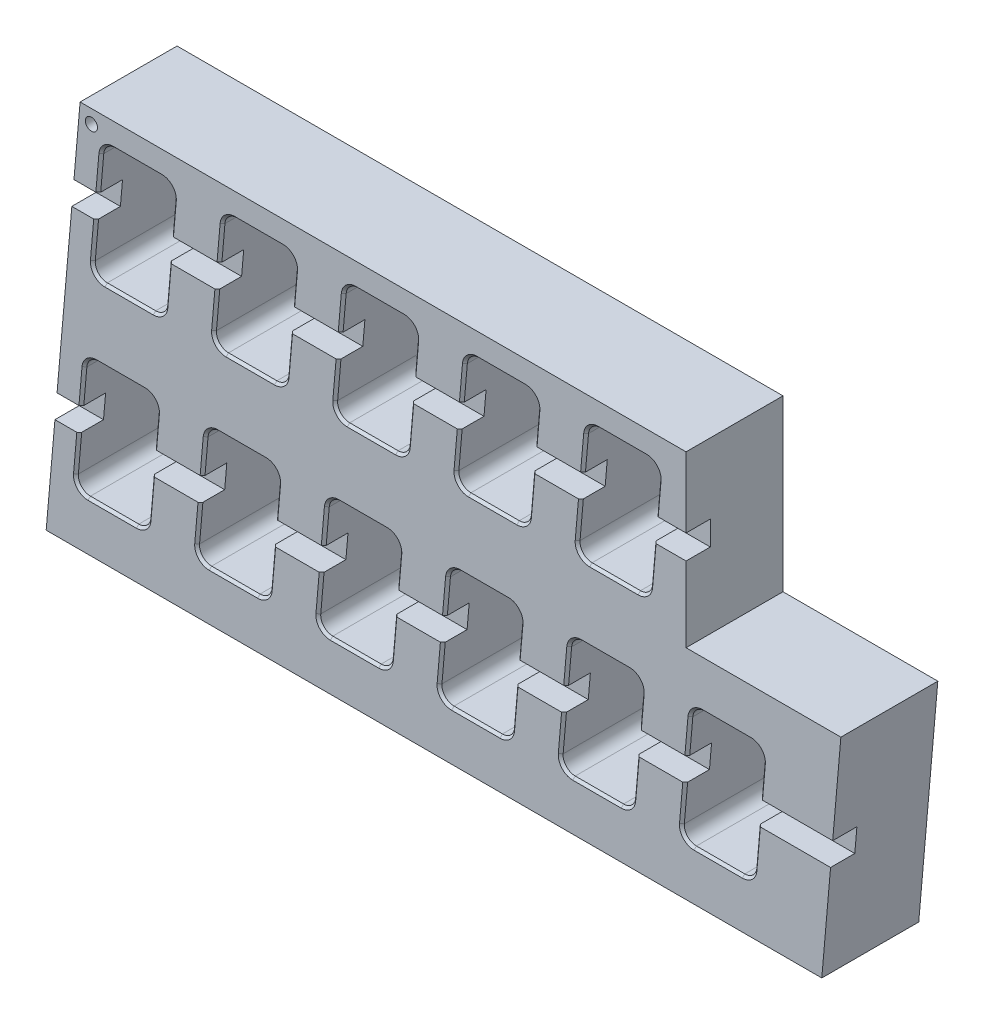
from build123d import *

# Parameters (mm, degrees)
EXTRUDE1_DEPTH             = 20
CUT_EXTRUDE1_DEPTH         = 20
CHAMFER1_SIZE              = 0.5
LPATTERN2_COUNT            = 6
LPATTERN2_PITCH            = 25
LPATTERN2_COUNT_DIR2       = 2
LPATTERN2_PITCH_DIR2       = 40
CHAMFER1_OF_LPATTERN2_SIZE = 0.5
CUT_EXTRUDE2_DEPTH         = 5
SKETCH6_R                  = 1.25
CUT_EXTRUDE5_DEPTH         = 10
SKETCH7_W                  = 40.988168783
SKETCH7_H                  = 43.465740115
CUT_EXTRUDE6_DEPTH         = 187.249019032


with BuildPart() as part:
    # Sketch1 → Extrude1 (new body)
    with BuildSketch(Plane.XY):
        Polygon((0, 0), (160, 0), (166.999093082, 80), (6.999093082, 80), align=None)
    extrude(amount=EXTRUDE1_DEPTH)

    # Sketch2 → Cut-Extrude1 (cut)
    with BuildSketch(Plane.XY.offset(20)):
        with BuildLine():
            Line((11.381090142, 72.717889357), (9.631316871, 52.717889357))
            ThreePointArc((9.631316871, 52.717889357), (10.278610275, 50.811024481), (12.121803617, 50))
            Line((12.121803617, 50), (22.102704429, 50))
            ThreePointArc((22.102704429, 50), (23.791679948, 50.656806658), (24.593191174, 52.282110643))
            Line((24.593191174, 52.282110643), (26.342964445, 72.282110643))
            ThreePointArc((26.342964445, 72.282110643), (25.695671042, 74.188975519), (23.852477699, 75))
            Line((23.852477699, 75), (13.871576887, 75))
            ThreePointArc((13.871576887, 75), (12.182601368, 74.343193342), (11.381090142, 72.717889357))
        make_face()
    cut_extrude1 = extrude(amount=-CUT_EXTRUDE1_DEPTH, mode=Mode.SUBTRACT)

    # Chamfer1
    chamfer1_edges = [part.edges().sort_by_distance(p)[0] for p in [
        (12.182601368, 74.343193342, 20),
        (10.506203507, 62.717889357, 20),
        (10.278610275, 50.811024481, 20),
        (17.112254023, 50, 20),
        (23.791679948, 50.656806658, 20),
        (25.468077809, 62.282110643, 20),
        (25.695671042, 74.188975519, 20),
        (18.862027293, 75, 20),
    ]]
    chamfer(chamfer1_edges, length=CHAMFER1_SIZE)

    # LPattern2: Cut-Extrude1 6 × 2
    with Locations(*[Vector(1, 0, 0) * (i * LPATTERN2_PITCH) + Vector(-0.08715574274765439, -0.9961946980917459, 0) * (j * LPATTERN2_PITCH_DIR2) for i in range(LPATTERN2_COUNT) for j in range(LPATTERN2_COUNT_DIR2) if (i, j) != (0, 0)]):
        add(cut_extrude1, mode=Mode.SUBTRACT)

    # Chamfer1 of LPattern2
    chamfer1_of_lpattern2_edges = [part.edges().sort_by_distance(p)[0] for p in [
        (8.696371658, 34.495405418, 20),
        (7.019973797, 22.870101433, 20),
        (6.792380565, 10.963236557, 20),
        (13.626024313, 10.152212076, 20),
        (20.305450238, 10.809018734, 20),
        (21.9818481, 22.434322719, 20),
        (22.209441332, 34.341187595, 20),
        (15.375797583, 35.152212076, 20),
        (37.182601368, 74.343193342, 20),
        (35.506203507, 62.717889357, 20),
        (35.278610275, 50.811024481, 20),
        (42.112254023, 50, 20),
        (48.791679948, 50.656806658, 20),
        (50.468077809, 62.282110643, 20),
        (50.695671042, 74.188975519, 20),
        (43.862027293, 75, 20),
        (33.696371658, 34.495405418, 20),
        (32.019973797, 22.870101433, 20),
        (31.792380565, 10.963236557, 20),
        (38.626024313, 10.152212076, 20),
        (45.305450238, 10.809018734, 20),
        (46.9818481, 22.434322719, 20),
        (47.209441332, 34.341187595, 20),
        (40.375797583, 35.152212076, 20),
        (62.182601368, 74.343193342, 20),
        (60.506203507, 62.717889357, 20),
        (60.278610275, 50.811024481, 20),
        (67.112254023, 50, 20),
        (73.791679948, 50.656806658, 20),
        (75.468077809, 62.282110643, 20),
        (75.695671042, 74.188975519, 20),
        (68.862027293, 75, 20),
        (58.696371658, 34.495405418, 20),
        (57.019973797, 22.870101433, 20),
        (56.792380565, 10.963236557, 20),
        (63.626024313, 10.152212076, 20),
        (70.305450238, 10.809018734, 20),
        (71.9818481, 22.434322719, 20),
        (72.209441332, 34.341187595, 20),
        (65.375797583, 35.152212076, 20),
        (87.182601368, 74.343193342, 20),
        (85.506203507, 62.717889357, 20),
        (85.278610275, 50.811024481, 20),
        (92.112254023, 50, 20),
        (98.791679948, 50.656806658, 20),
        (100.468077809, 62.282110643, 20),
        (100.695671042, 74.188975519, 20),
        (93.862027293, 75, 20),
        (83.696371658, 34.495405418, 20),
        (82.019973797, 22.870101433, 20),
        (81.792380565, 10.963236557, 20),
        (88.626024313, 10.152212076, 20),
        (95.305450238, 10.809018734, 20),
        (96.9818481, 22.434322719, 20),
        (97.209441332, 34.341187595, 20),
        (90.375797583, 35.152212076, 20),
        (112.182601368, 74.343193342, 20),
        (110.506203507, 62.717889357, 20),
        (110.278610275, 50.811024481, 20),
        (117.112254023, 50, 20),
        (123.791679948, 50.656806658, 20),
        (125.468077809, 62.282110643, 20),
        (125.695671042, 74.188975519, 20),
        (118.862027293, 75, 20),
        (108.696371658, 34.495405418, 20),
        (107.019973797, 22.870101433, 20),
        (106.792380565, 10.963236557, 20),
        (113.626024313, 10.152212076, 20),
        (120.305450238, 10.809018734, 20),
        (121.9818481, 22.434322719, 20),
        (122.209441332, 34.341187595, 20),
        (115.375797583, 35.152212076, 20),
        (137.182601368, 74.343193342, 20),
        (135.506203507, 62.717889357, 20),
        (135.278610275, 50.811024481, 20),
        (142.112254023, 50, 20),
        (148.791679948, 50.656806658, 20),
        (150.468077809, 62.282110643, 20),
        (150.695671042, 74.188975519, 20),
        (143.862027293, 75, 20),
        (133.696371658, 34.495405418, 20),
        (132.019973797, 22.870101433, 20),
        (131.792380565, 10.963236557, 20),
        (138.626024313, 10.152212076, 20),
        (145.305450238, 10.809018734, 20),
        (146.9818481, 22.434322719, 20),
        (147.209441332, 34.341187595, 20),
        (140.375797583, 35.152212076, 20),
    ]]
    chamfer(chamfer1_of_lpattern2_edges, length=CHAMFER1_OF_LPATTERN2_SIZE)

    # Sketch3 → Cut-Extrude2 (cut)
    with BuildSketch(Plane.XY.offset(20)):
        Polygon((3.285424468, 60.5), (167.300703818, 60.5), (167.738147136, 65.5), (3.722867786, 65.5), align=None)
        Polygon((-0.200805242, 20.652212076), (163.814474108, 20.652212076), (164.251917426, 25.652212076), (0.236638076, 25.652212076), align=None)
    extrude(amount=-CUT_EXTRUDE2_DEPTH, mode=Mode.SUBTRACT)

    # Sketch6 → Cut-Extrude5 (cut)
    with BuildSketch(Plane.XY.offset(20)):
        with Locations((9.338382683, 77.198904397)):
            Circle(SKETCH6_R)
    extrude(amount=-CUT_EXTRUDE5_DEPTH, mode=Mode.SUBTRACT)

    # Sketch7 → Cut-Extrude6 (cut, through all)
    with BuildSketch(Plane.XY.offset(20)):
        with Locations((152.493177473, 66.732870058)):
            Rectangle(SKETCH7_W, SKETCH7_H)
    extrude(amount=-CUT_EXTRUDE6_DEPTH, mode=Mode.SUBTRACT)


solid = part.part
